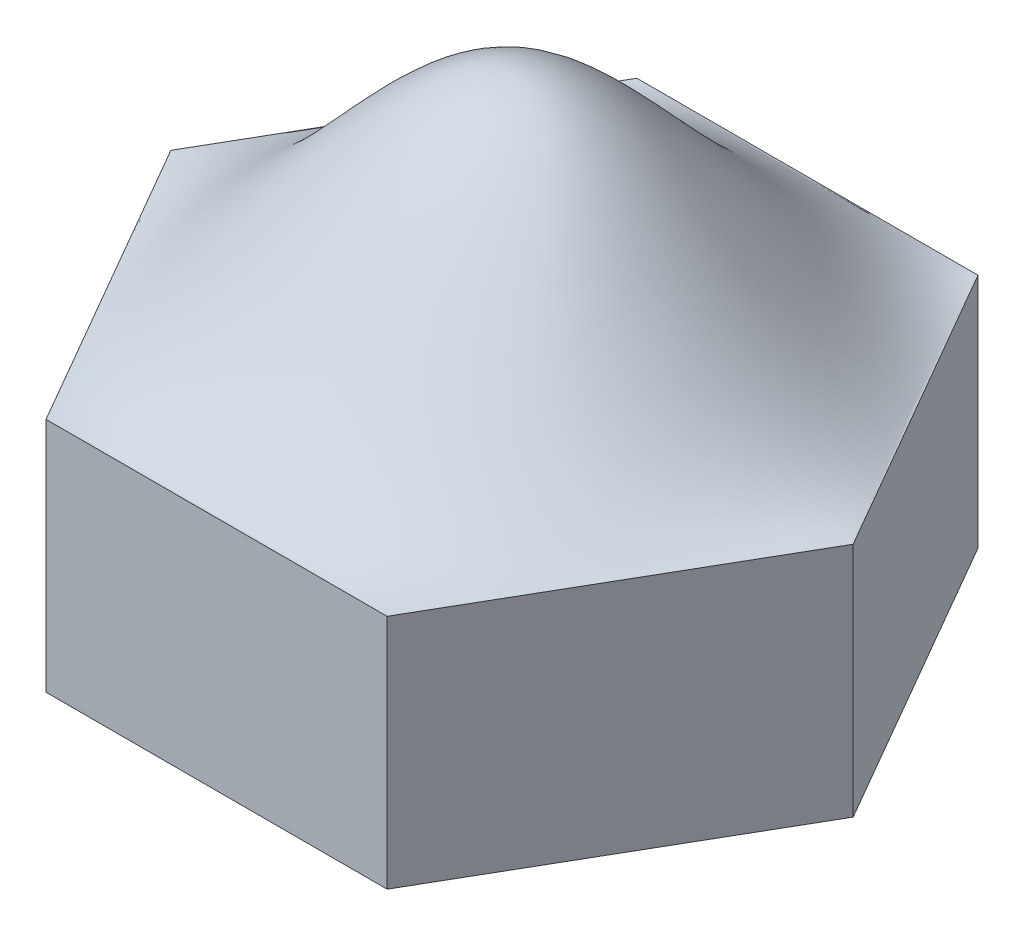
ISO-10303-21;
HEADER;
FILE_DESCRIPTION(('STEP AP214'),'2;1');
FILE_NAME('part.step','',(''),(''),'','','');
FILE_SCHEMA(('AUTOMOTIVE_DESIGN { 1 0 10303 214 1 1 1 1 }'));
ENDSEC;
DATA;
#1=APPLICATION_CONTEXT('core data for automotive mechanical design processes');
#2=APPLICATION_PROTOCOL_DEFINITION('international standard','automotive_design',2000,#1);
#3=PRODUCT_CONTEXT('',#1,'mechanical');
#4=PRODUCT('Part','Part','',(#3));
#5=PRODUCT_RELATED_PRODUCT_CATEGORY('part','',(#4));
#6=PRODUCT_DEFINITION_FORMATION('','',#4);
#7=PRODUCT_DEFINITION_CONTEXT('part definition',#1,'design');
#8=PRODUCT_DEFINITION('design','',#6,#7);
#9=PRODUCT_DEFINITION_SHAPE('','',#8);
#10=(LENGTH_UNIT() NAMED_UNIT(*) SI_UNIT(.MILLI.,.METRE.));
#11=(NAMED_UNIT(*) PLANE_ANGLE_UNIT() SI_UNIT($,.RADIAN.));
#12=(NAMED_UNIT(*) SI_UNIT($,.STERADIAN.) SOLID_ANGLE_UNIT());
#13=UNCERTAINTY_MEASURE_WITH_UNIT(LENGTH_MEASURE(1.E-05),#10,'distance_accuracy_value','');
#14=(GEOMETRIC_REPRESENTATION_CONTEXT(3) GLOBAL_UNCERTAINTY_ASSIGNED_CONTEXT((#13)) GLOBAL_UNIT_ASSIGNED_CONTEXT((#10,
#11,#12)) REPRESENTATION_CONTEXT('',''));
#15=CARTESIAN_POINT('',(0.,0.,0.));
#16=DIRECTION('',(0.,0.,1.));
#17=DIRECTION('',(1.,0.,0.));
#18=AXIS2_PLACEMENT_3D('',#15,#16,#17);
#19=CARTESIAN_POINT('',(28.8675134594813,40.,50.));
#20=DIRECTION('',(-0.866025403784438,0.,-0.5));
#21=DIRECTION('',(-0.5,0.,0.866025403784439));
#22=AXIS2_PLACEMENT_3D('',#19,#20,#21);
#23=PLANE('',#22);
#24=DIRECTION('',(0.5,0.,-0.866025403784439));
#25=VECTOR('',#24,1.);
#26=CARTESIAN_POINT('',(28.8675134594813,0.,50.));
#27=LINE('',#26,#25);
#28=CARTESIAN_POINT('',(28.8675134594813,0.,50.));
#29=VERTEX_POINT('',#28);
#30=CARTESIAN_POINT('',(57.7350269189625,0.,0.));
#31=VERTEX_POINT('',#30);
#32=EDGE_CURVE('E252',#29,#31,#27,.T.);
#33=ORIENTED_EDGE('',*,*,#32,.T.);
#34=DIRECTION('',(0.,-1.,0.));
#35=VECTOR('',#34,1.);
#36=CARTESIAN_POINT('',(57.7350269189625,40.,0.));
#37=LINE('',#36,#35);
#38=CARTESIAN_POINT('',(57.7350267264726,39.9990985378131,-3.33402296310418E-07));
#39=VERTEX_POINT('',#38);
#40=EDGE_CURVE('E13',#39,#31,#37,.T.);
#41=ORIENTED_EDGE('',*,*,#40,.F.);
#42=CARTESIAN_POINT('',(28.8675136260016,39.9993655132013,49.9999997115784));
#43=CARTESIAN_POINT('',(29.033116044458,39.9997100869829,49.7131679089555));
#44=CARTESIAN_POINT('',(29.1987185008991,39.9999448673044,49.4263360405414));
#45=CARTESIAN_POINT('',(29.5299234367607,40.0002662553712,48.8526722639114));
#46=CARTESIAN_POINT('',(29.6955259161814,40.0003528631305,48.5658403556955));
#47=CARTESIAN_POINT('',(30.1923333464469,40.0004975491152,47.7053446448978));
#48=CARTESIAN_POINT('',(30.5235382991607,40.000440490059,47.1316808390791));
#49=CARTESIAN_POINT('',(31.1859481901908,40.0003053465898,45.9843532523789));
#50=CARTESIAN_POINT('',(31.517153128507,40.0002272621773,45.4106894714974));
#51=CARTESIAN_POINT('',(32.1795630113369,40.000117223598,44.2633618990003));
#52=CARTESIAN_POINT('',(32.5107679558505,40.0000852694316,43.6896981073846));
#53=CARTESIAN_POINT('',(33.1731778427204,40.0000407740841,42.5423705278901));
#54=CARTESIAN_POINT('',(33.5043827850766,40.0000282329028,41.9687067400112));
#55=CARTESIAN_POINT('',(34.1667926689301,39.9999853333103,40.8213791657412));
#56=CARTESIAN_POINT('',(34.4979976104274,39.9999549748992,40.24771537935));
#57=CARTESIAN_POINT('',(35.4916124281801,39.9998159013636,38.526724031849));
#58=CARTESIAN_POINT('',(36.1540223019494,39.9996591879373,37.3793964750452));
#59=CARTESIAN_POINT('',(37.4788420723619,39.9995369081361,35.0847413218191));
#60=CARTESIAN_POINT('',(38.141251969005,39.9995713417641,33.9374137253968));
#61=CARTESIAN_POINT('',(39.4660717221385,39.9999895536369,31.6427586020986));
#62=CARTESIAN_POINT('',(40.1284815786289,40.0003733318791,30.4954310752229));
#63=CARTESIAN_POINT('',(41.4533013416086,40.0009219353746,28.2007759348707));
#64=CARTESIAN_POINT('',(42.1157112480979,40.0010867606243,27.0534483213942));
#65=CARTESIAN_POINT('',(43.1093260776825,40.00083322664,25.3324569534));
#66=CARTESIAN_POINT('',(43.4405310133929,40.0006652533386,24.7587931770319));
#67=CARTESIAN_POINT('',(44.1029408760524,40.0002330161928,23.6114656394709));
#68=CARTESIAN_POINT('',(44.4341458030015,39.9999687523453,23.0378018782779));
#69=CARTESIAN_POINT('',(45.0355523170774,39.9995348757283,21.9961352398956));
#70=CARTESIAN_POINT('',(45.3057539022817,39.99935679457,21.5281323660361));
#71=CARTESIAN_POINT('',(45.8461570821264,39.9991779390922,20.5921266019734));
#72=CARTESIAN_POINT('',(46.1163586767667,39.9991771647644,20.1241237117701));
#73=CARTESIAN_POINT('',(46.656761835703,39.9994089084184,19.1881179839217));
#74=CARTESIAN_POINT('',(46.926963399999,39.9996414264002,18.7201151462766));
#75=CARTESIAN_POINT('',(47.4673665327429,40.0001095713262,17.7841094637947));
#76=CARTESIAN_POINT('',(47.7375681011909,40.0003451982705,17.316106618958));
#77=CARTESIAN_POINT('',(48.5481728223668,40.0008937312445,15.9120980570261));
#78=CARTESIAN_POINT('',(49.0885760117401,40.0010482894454,14.9760922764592));
#79=CARTESIAN_POINT('',(50.1693823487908,40.00082701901,13.1040807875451));
#80=CARTESIAN_POINT('',(50.7097854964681,40.0004511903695,12.1680750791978));
#81=CARTESIAN_POINT('',(51.7905917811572,39.9996758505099,10.2960636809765));
#82=CARTESIAN_POINT('',(52.330994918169,39.9992763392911,9.36005799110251));
#83=CARTESIAN_POINT('',(53.4118012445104,39.9989960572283,7.48804652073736));
#84=CARTESIAN_POINT('',(53.95220443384,39.9991152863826,6.55204074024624));
#85=CARTESIAN_POINT('',(54.7628091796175,39.9996483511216,5.14803213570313));
#86=CARTESIAN_POINT('',(55.0330107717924,39.999885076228,4.68002924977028));
#87=CARTESIAN_POINT('',(55.5734139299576,40.0003560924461,3.74402352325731));
#88=CARTESIAN_POINT('',(55.8436154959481,40.000590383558,3.2760206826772));
#89=CARTESIAN_POINT('',(56.3840186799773,40.0008690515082,2.34001491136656));
#90=CARTESIAN_POINT('',(56.6542202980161,40.000913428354,1.87201198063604));
#91=CARTESIAN_POINT('',(57.1946235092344,40.0004803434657,0.936006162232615));
#92=CARTESIAN_POINT('',(57.4648251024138,40.0000028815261,0.468003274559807));
#93=CARTESIAN_POINT('',(57.7350265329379,39.9990985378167,6.68614285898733E-07));
#94=B_SPLINE_CURVE_WITH_KNOTS('',3,(#42,#43,#44,#45,#46,#47,#48,#49,#50,#51,#52,#53,#54,#55,#56,
#57,#58,#59,#60,#61,#62,#63,#64,#65,#66,#67,#68,#69,#70,#71,#72,#73,#74,#75,#76,#77,#78,#79,#80,
#81,#82,#83,#84,#85,#86,#87,#88,#89,#90,#91,#92,#93),.UNSPECIFIED.,.F.,.F.,(4,2,2,2,2,2,2,2,2,2,
2,2,2,2,2,2,2,2,2,2,2,2,2,2,2,4),(0.,0.993614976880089,1.98722985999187,3.97445956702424,
5.96168921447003,7.9489188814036,9.93614853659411,11.9233781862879,15.8978374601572,
19.8722967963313,23.8467561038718,27.821215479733,29.8084451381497,31.7956748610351,
33.4168844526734,35.0380939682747,36.6593034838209,38.280513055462,41.5229320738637,
44.7653511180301,48.0077701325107,51.2501891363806,52.8713988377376,54.4926084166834,
56.1138179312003,57.7350280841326),.UNSPECIFIED.);
#95=CARTESIAN_POINT('',(28.867513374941,39.9993655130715,50.));
#96=VERTEX_POINT('',#95);
#97=EDGE_CURVE('E268',#96,#39,#94,.T.);
#98=ORIENTED_EDGE('',*,*,#97,.F.);
#99=DIRECTION('',(0.,-1.,0.));
#100=VECTOR('',#99,1.);
#101=CARTESIAN_POINT('',(28.8675134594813,40.,50.));
#102=LINE('',#101,#100);
#103=EDGE_CURVE('E260',#96,#29,#102,.T.);
#104=ORIENTED_EDGE('',*,*,#103,.T.);
#105=EDGE_LOOP('',(#33,#41,#98,#104));
#106=FACE_BOUND('',#105,.T.);
#107=ADVANCED_FACE('F176',(#106),#23,.F.);
#108=CARTESIAN_POINT('',(57.7350269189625,40.,0.));
#109=DIRECTION('',(-0.866025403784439,0.,0.5));
#110=DIRECTION('',(0.5,0.,0.866025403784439));
#111=AXIS2_PLACEMENT_3D('',#108,#109,#110);
#112=PLANE('',#111);
#113=DIRECTION('',(-0.5,0.,-0.866025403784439));
#114=VECTOR('',#113,1.);
#115=CARTESIAN_POINT('',(57.7350269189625,0.,0.));
#116=LINE('',#115,#114);
#117=CARTESIAN_POINT('',(28.8675134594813,0.,-50.));
#118=VERTEX_POINT('',#117);
#119=EDGE_CURVE('E249',#31,#118,#116,.T.);
#120=ORIENTED_EDGE('',*,*,#119,.T.);
#121=DIRECTION('',(0.,-1.,0.));
#122=VECTOR('',#121,1.);
#123=CARTESIAN_POINT('',(28.8675134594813,40.,-50.));
#124=LINE('',#123,#122);
#125=CARTESIAN_POINT('',(28.8675133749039,39.9993647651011,-50.));
#126=VERTEX_POINT('',#125);
#127=EDGE_CURVE('E194',#126,#118,#124,.T.);
#128=ORIENTED_EDGE('',*,*,#127,.F.);
#129=CARTESIAN_POINT('',(57.7350265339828,39.9990985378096,-6.6680459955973E-07));
#130=CARTESIAN_POINT('',(57.5694240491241,39.9996618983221,-0.286832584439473));
#131=CARTESIAN_POINT('',(57.4038214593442,40.000054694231,-0.573664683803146));
#132=CARTESIAN_POINT('',(57.0726162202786,40.0005911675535,-1.14732898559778));
#133=CARTESIAN_POINT('',(56.9070135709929,40.0007348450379,-1.43416118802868));
#134=CARTESIAN_POINT('',(56.4102056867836,40.0009302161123,-2.2946576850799));
#135=CARTESIAN_POINT('',(56.0790004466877,40.0007462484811,-2.86832198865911));
#136=CARTESIAN_POINT('',(55.4165900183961,40.000245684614,-4.01565050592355));
#137=CARTESIAN_POINT('',(55.0853848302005,39.9999290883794,-4.58931471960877));
#138=CARTESIAN_POINT('',(54.422974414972,39.9994167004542,-5.7366432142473));
#139=CARTESIAN_POINT('',(54.0917691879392,39.9992209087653,-6.3103074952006));
#140=CARTESIAN_POINT('',(53.0981535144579,39.9989703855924,-8.03130032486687));
#141=CARTESIAN_POINT('',(52.4357430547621,39.9992525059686,-9.17862889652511));
#142=CARTESIAN_POINT('',(51.1109222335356,40.0000946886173,-11.4732858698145));
#143=CARTESIAN_POINT('',(50.4485118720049,40.0006547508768,-12.6206142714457));
#144=CARTESIAN_POINT('',(49.4548962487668,40.0009682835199,-14.3416070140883));
#145=CARTESIAN_POINT('',(49.1236910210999,40.0009850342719,-14.9152712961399));
#146=CARTESIAN_POINT('',(48.4612805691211,40.0008218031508,-16.0625998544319));
#147=CARTESIAN_POINT('',(48.1300753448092,40.0006418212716,-16.6362641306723));
#148=CARTESIAN_POINT('',(47.4676649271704,40.0001432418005,-17.7835926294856));
#149=CARTESIAN_POINT('',(47.1364597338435,39.9998246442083,-18.3572568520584));
#150=CARTESIAN_POINT('',(46.4740493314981,39.9993203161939,-19.5045853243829));
#151=CARTESIAN_POINT('',(46.1428441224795,39.9991345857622,-20.0782495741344));
#152=CARTESIAN_POINT('',(45.480433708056,39.9991420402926,-21.2255780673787));
#153=CARTESIAN_POINT('',(45.1492285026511,39.9993352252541,-21.7992423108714));
#154=CARTESIAN_POINT('',(44.4868180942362,39.9997968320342,-22.9465707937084));
#155=CARTESIAN_POINT('',(44.1556128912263,40.0000652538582,-23.5202350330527));
#156=CARTESIAN_POINT('',(43.493202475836,40.0005236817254,-24.6675635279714));
#157=CARTESIAN_POINT('',(43.1619972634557,40.0007136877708,-25.2412277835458));
#158=CARTESIAN_POINT('',(42.4995868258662,40.0009415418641,-26.3885563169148));
#159=CARTESIAN_POINT('',(42.168381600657,40.0009793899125,-26.9622205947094));
#160=CARTESIAN_POINT('',(41.2967737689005,40.0009006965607,-28.4718896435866));
#161=CARTESIAN_POINT('',(40.7563711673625,40.0006715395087,-29.4078944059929));
#162=CARTESIAN_POINT('',(39.6755659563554,40.0001823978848,-31.2799039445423));
#163=CARTESIAN_POINT('',(39.1351633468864,39.9999224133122,-32.2159087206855));
#164=CARTESIAN_POINT('',(38.0543581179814,39.9996159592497,-34.087918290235));
#165=CARTESIAN_POINT('',(37.5139554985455,39.9995694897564,-35.0239230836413));
#166=CARTESIAN_POINT('',(36.4331502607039,39.9996264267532,-36.8959326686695));
#167=CARTESIAN_POINT('',(35.8927476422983,39.9997298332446,-37.8319374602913));
#168=CARTESIAN_POINT('',(34.811942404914,39.9998945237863,-39.7039470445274));
#169=CARTESIAN_POINT('',(34.2715397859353,39.9999558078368,-40.6399518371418));
#170=CARTESIAN_POINT('',(33.1907345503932,40.0000368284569,-42.5119614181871));
#171=CARTESIAN_POINT('',(32.6503319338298,40.0000565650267,-43.4479662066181));
#172=CARTESIAN_POINT('',(31.8397280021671,40.0001726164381,-44.851973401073));
#173=CARTESIAN_POINT('',(31.5695266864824,40.0002257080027,-45.319975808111));
#174=CARTESIAN_POINT('',(31.0291240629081,40.0003426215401,-46.255980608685));
#175=CARTESIAN_POINT('',(30.7589227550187,40.0004064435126,-46.7239830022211));
#176=CARTESIAN_POINT('',(30.2185201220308,40.0004714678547,-47.6599878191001));
#177=CARTESIAN_POINT('',(29.9483187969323,40.0004726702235,-48.1279902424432));
#178=CARTESIAN_POINT('',(29.4079161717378,40.0001890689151,-49.0639950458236));
#179=CARTESIAN_POINT('',(29.1377148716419,39.9999042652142,-49.531997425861));
#180=CARTESIAN_POINT('',(28.8675136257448,39.9993647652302,-49.9999997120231));
#181=B_SPLINE_CURVE_WITH_KNOTS('',3,(#129,#130,#131,#132,#133,#134,#135,#136,#137,#138,#139,
#140,#141,#142,#143,#144,#145,#146,#147,#148,#149,#150,#151,#152,#153,#154,#155,#156,#157,#158,
#159,#160,#161,#162,#163,#164,#165,#166,#167,#168,#169,#170,#171,#172,#173,#174,#175,#176,#177,
#178,#179,#180),.UNSPECIFIED.,.F.,.F.,(4,2,2,2,2,2,2,2,2,2,2,2,2,2,2,2,2,2,2,2,2,2,2,2,2,4),(0.,
0.993616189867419,1.98723209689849,3.97446349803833,5.96169488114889,7.94892628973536,
11.9233889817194,15.897851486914,17.8850828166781,19.8723142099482,21.8595456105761,
23.8467768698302,25.8340081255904,27.8212395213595,29.8084708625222,31.7957021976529,
35.0381178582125,38.2805336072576,41.5229493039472,44.7653650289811,48.0077807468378,
51.2501964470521,52.8714043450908,54.4926122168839,56.1138201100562,57.7350281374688),.UNSPECIFIED.);
#182=EDGE_CURVE('E183',#39,#126,#181,.T.);
#183=ORIENTED_EDGE('',*,*,#182,.F.);
#184=ORIENTED_EDGE('',*,*,#40,.T.);
#185=EDGE_LOOP('',(#120,#128,#183,#184));
#186=FACE_BOUND('',#185,.T.);
#187=ADVANCED_FACE('F257',(#186),#112,.F.);
#188=CARTESIAN_POINT('',(28.8675134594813,40.,-50.));
#189=DIRECTION('',(0.,0.,1.));
#190=DIRECTION('',(1.,0.,0.));
#191=AXIS2_PLACEMENT_3D('',#188,#189,#190);
#192=PLANE('',#191);
#193=DIRECTION('',(-1.,0.,0.));
#194=VECTOR('',#193,1.);
#195=CARTESIAN_POINT('',(28.8675134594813,0.,-50.));
#196=LINE('',#195,#194);
#197=CARTESIAN_POINT('',(-28.8675134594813,0.,-50.));
#198=VERTEX_POINT('',#197);
#199=EDGE_CURVE('E254',#118,#198,#196,.T.);
#200=ORIENTED_EDGE('',*,*,#199,.T.);
#201=DIRECTION('',(0.,-1.,0.));
#202=VECTOR('',#201,1.);
#203=CARTESIAN_POINT('',(-28.8675134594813,40.,-50.));
#204=LINE('',#203,#202);
#205=CARTESIAN_POINT('',(-28.8675135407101,39.9993764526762,-49.9999998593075));
#206=VERTEX_POINT('',#205);
#207=EDGE_CURVE('E272',#206,#198,#204,.T.);
#208=ORIENTED_EDGE('',*,*,#207,.F.);
#209=CARTESIAN_POINT('',(28.8675132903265,39.9993647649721,-50.));
#210=CARTESIAN_POINT('',(28.5363085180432,39.9995351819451,-50.));
#211=CARTESIAN_POINT('',(28.205103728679,39.9996399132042,-50.));
#212=CARTESIAN_POINT('',(27.5426941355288,39.9997834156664,-50.));
#213=CARTESIAN_POINT('',(27.2114893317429,39.9998221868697,-50.));
#214=CARTESIAN_POINT('',(26.2178749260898,39.9999376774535,-50.));
#215=CARTESIAN_POINT('',(25.5554653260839,40.0000135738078,-50.));
#216=CARTESIAN_POINT('',(23.5682365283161,40.0001938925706,-50.));
#217=CARTESIAN_POINT('',(22.2434173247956,40.0002509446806,-50.));
#218=CARTESIAN_POINT('',(18.2689597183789,40.0003271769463,-50.));
#219=CARTESIAN_POINT('',(15.6193213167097,40.0002514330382,-50.));
#220=CARTESIAN_POINT('',(10.3200448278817,40.0000590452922,-50.));
#221=CARTESIAN_POINT('',(7.67040674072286,39.9999424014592,-50.));
#222=CARTESIAN_POINT('',(2.37113056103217,39.9998049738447,-50.));
#223=CARTESIAN_POINT('',(-0.278507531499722,39.9997841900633,-49.9999999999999));
#224=CARTESIAN_POINT('',(-5.08975960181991,39.9998512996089,-49.9999999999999));
#225=CARTESIAN_POINT('',(-7.25137357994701,39.9999198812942,-50.));
#226=CARTESIAN_POINT('',(-11.5746015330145,40.0000872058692,-50.));
#227=CARTESIAN_POINT('',(-13.7362155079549,40.0001859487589,-50.));
#228=CARTESIAN_POINT('',(-18.0594434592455,40.0003098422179,-50.));
#229=CARTESIAN_POINT('',(-20.2210574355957,40.0003349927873,-50.));
#230=CARTESIAN_POINT('',(-23.4634784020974,40.0002006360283,-50.));
#231=CARTESIAN_POINT('',(-24.5442853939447,40.000127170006,-50.));
#232=CARTESIAN_POINT('',(-26.1654958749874,39.9999455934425,-50.));
#233=CARTESIAN_POINT('',(-26.7058993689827,39.999873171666,-50.));
#234=CARTESIAN_POINT('',(-27.5165046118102,39.9997550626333,-50.));
#235=CARTESIAN_POINT('',(-27.7867063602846,39.999714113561,-50.));
#236=CARTESIAN_POINT('',(-28.3271098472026,39.9995883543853,-50.));
#237=CARTESIAN_POINT('',(-28.5973115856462,39.9995035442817,-50.));
#238=CARTESIAN_POINT('',(-28.8675133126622,39.9993764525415,-50.));
#239=B_SPLINE_CURVE_WITH_KNOTS('',3,(#209,#210,#211,#212,#213,#214,#215,#216,#217,#218,#219,
#220,#221,#222,#223,#224,#225,#226,#227,#228,#229,#230,#231,#232,#233,#234,#235,#236,#237,#238),
.UNSPECIFIED.,.F.,.F.,(4,2,2,2,2,2,2,2,2,2,2,2,2,2,4),(0.,0.993614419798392,1.98722883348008,
3.97445764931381,7.94891525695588,15.8978304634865,23.8467447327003,31.7956590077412,
38.2805009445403,44.765342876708,51.2501848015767,54.4926057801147,56.1138162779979,
56.9244215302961,57.7350267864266),.UNSPECIFIED.);
#240=EDGE_CURVE('E302',#126,#206,#239,.T.);
#241=ORIENTED_EDGE('',*,*,#240,.F.);
#242=ORIENTED_EDGE('',*,*,#127,.T.);
#243=EDGE_LOOP('',(#200,#208,#241,#242));
#244=FACE_BOUND('',#243,.T.);
#245=ADVANCED_FACE('F294',(#244),#192,.F.);
#246=CARTESIAN_POINT('',(-28.8675134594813,40.,-50.));
#247=DIRECTION('',(0.866025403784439,0.,0.5));
#248=DIRECTION('',(0.5,0.,-0.866025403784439));
#249=AXIS2_PLACEMENT_3D('',#246,#247,#248);
#250=PLANE('',#249);
#251=DIRECTION('',(-0.5,0.,0.866025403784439));
#252=VECTOR('',#251,1.);
#253=CARTESIAN_POINT('',(-28.8675134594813,0.,-50.));
#254=LINE('',#253,#252);
#255=CARTESIAN_POINT('',(-57.7350269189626,0.,0.));
#256=VERTEX_POINT('',#255);
#257=EDGE_CURVE('E264',#198,#256,#254,.T.);
#258=ORIENTED_EDGE('',*,*,#257,.T.);
#259=DIRECTION('',(0.,-1.,0.));
#260=VECTOR('',#259,1.);
#261=CARTESIAN_POINT('',(-57.7350269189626,40.,0.));
#262=LINE('',#261,#260);
#263=CARTESIAN_POINT('',(-57.7350267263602,39.9990994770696,3.33597084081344E-07));
#264=VERTEX_POINT('',#263);
#265=EDGE_CURVE('E275',#264,#256,#262,.T.);
#266=ORIENTED_EDGE('',*,*,#265,.F.);
#267=CARTESIAN_POINT('',(-28.867513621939,39.9993764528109,-49.9999997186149));
#268=CARTESIAN_POINT('',(-29.0331160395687,39.9997185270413,-49.7131679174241));
#269=CARTESIAN_POINT('',(-29.1987184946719,39.9999513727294,-49.4263360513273));
#270=CARTESIAN_POINT('',(-29.5299234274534,40.0002696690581,-48.8526722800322));
#271=CARTESIAN_POINT('',(-29.6955259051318,40.0003551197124,-48.5658403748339));
#272=CARTESIAN_POINT('',(-30.1923333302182,40.0004969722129,-47.7053446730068));
#273=CARTESIAN_POINT('',(-30.5235382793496,40.0004388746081,-47.1316808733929));
#274=CARTESIAN_POINT('',(-31.1859481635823,40.0003022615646,-45.984353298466));
#275=CARTESIAN_POINT('',(-31.5171530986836,40.0002237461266,-45.4106895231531));
#276=CARTESIAN_POINT('',(-32.179562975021,40.0001131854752,-44.2633619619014));
#277=CARTESIAN_POINT('',(-32.5107679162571,40.0000811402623,-43.6896981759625));
#278=CARTESIAN_POINT('',(-33.1731777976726,40.0000368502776,-42.5423706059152));
#279=CARTESIAN_POINT('',(-33.504382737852,40.0000246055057,-41.9687068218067));
#280=CARTESIAN_POINT('',(-34.1667926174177,39.9999828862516,-40.8213792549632));
#281=CARTESIAN_POINT('',(-34.4979975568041,39.9999534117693,-40.2477154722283));
#282=CARTESIAN_POINT('',(-35.4916123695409,39.9998181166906,-38.5267241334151));
#283=CARTESIAN_POINT('',(-36.1540222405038,39.9996654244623,-37.3793965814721));
#284=CARTESIAN_POINT('',(-37.4788420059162,39.9995533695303,-35.0847414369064));
#285=CARTESIAN_POINT('',(-38.1412519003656,39.9995940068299,-33.9374138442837));
#286=CARTESIAN_POINT('',(-39.4660716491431,40.0000142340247,-31.6427587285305));
#287=CARTESIAN_POINT('',(-40.1284815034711,40.000393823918,-30.4954312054));
#288=CARTESIAN_POINT('',(-41.4533012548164,40.0009313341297,-28.2007760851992));
#289=CARTESIAN_POINT('',(-42.1157111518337,40.0010892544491,-27.0534484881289));
#290=CARTESIAN_POINT('',(-43.4405309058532,40.0007008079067,-24.7587933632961));
#291=CARTESIAN_POINT('',(-44.1029407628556,40.0001544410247,-23.6114658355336));
#292=CARTESIAN_POINT('',(-45.0355522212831,39.9995106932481,-21.9961354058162));
#293=CARTESIAN_POINT('',(-45.3057538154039,39.999339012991,-21.5281325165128));
#294=CARTESIAN_POINT('',(-45.846157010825,39.9991962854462,-20.592126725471));
#295=CARTESIAN_POINT('',(-46.1163586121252,39.9992252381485,-20.1241238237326));
#296=CARTESIAN_POINT('',(-46.6567617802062,39.999486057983,-19.188118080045));
#297=CARTESIAN_POINT('',(-46.926963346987,39.9997179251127,-18.720115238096));
#298=CARTESIAN_POINT('',(-47.4673664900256,40.0001700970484,-17.7841095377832));
#299=CARTESIAN_POINT('',(-47.7375680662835,40.000390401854,-17.3161066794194));
#300=CARTESIAN_POINT('',(-48.5481728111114,40.0008930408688,-15.9120980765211));
#301=CARTESIAN_POINT('',(-49.0885760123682,40.0010170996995,-14.9760922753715));
#302=CARTESIAN_POINT('',(-50.1693823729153,40.0007697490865,-13.1040807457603));
#303=CARTESIAN_POINT('',(-50.7097855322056,40.0003983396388,-12.1680750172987));
#304=CARTESIAN_POINT('',(-51.7905918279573,39.9996466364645,-10.2960635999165));
#305=CARTESIAN_POINT('',(-52.3309949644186,39.9992663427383,-9.36005791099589));
#306=CARTESIAN_POINT('',(-53.4118012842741,39.9990118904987,-7.4880464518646));
#307=CARTESIAN_POINT('',(-53.9522044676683,39.9991377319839,-6.5520406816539));
#308=CARTESIAN_POINT('',(-54.7628092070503,39.9996682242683,-5.14803208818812));
#309=CARTESIAN_POINT('',(-55.0330107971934,39.9999020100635,-4.68002920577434));
#310=CARTESIAN_POINT('',(-55.5734139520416,40.0003655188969,-3.74402348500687));
#311=CARTESIAN_POINT('',(-55.8436155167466,40.0005952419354,-3.27602064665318));
#312=CARTESIAN_POINT('',(-56.3840186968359,40.0008664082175,-2.3400148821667));
#313=CARTESIAN_POINT('',(-56.6542203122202,40.0009078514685,-1.87201195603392));
#314=CARTESIAN_POINT('',(-57.1946235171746,40.0004736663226,-0.936006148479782));
#315=CARTESIAN_POINT('',(-57.4648251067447,39.9999980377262,-0.468003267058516));
#316=CARTESIAN_POINT('',(-57.7350265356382,39.9990994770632,-6.63937340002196E-07));
#317=B_SPLINE_CURVE_WITH_KNOTS('',3,(#267,#268,#269,#270,#271,#272,#273,#274,#275,#276,#277,
#278,#279,#280,#281,#282,#283,#284,#285,#286,#287,#288,#289,#290,#291,#292,#293,#294,#295,#296,
#297,#298,#299,#300,#301,#302,#303,#304,#305,#306,#307,#308,#309,#310,#311,#312,#313,#314,#315,
#316),.UNSPECIFIED.,.F.,.F.,(4,2,2,2,2,2,2,2,2,2,2,2,2,2,2,2,2,2,2,2,2,2,2,2,4),(0.,
0.99361496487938,1.9872298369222,3.97445952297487,5.9616891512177,7.94891879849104,
9.93614844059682,11.9233780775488,15.8978373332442,19.872296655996,23.8467559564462,
27.8212152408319,31.7956746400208,33.4168842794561,35.0380938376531,36.6593033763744,
38.2805129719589,41.5229320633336,44.7653511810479,48.0077701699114,51.2501891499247,
52.8713988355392,54.4926084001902,56.1138179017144,57.7350280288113),.UNSPECIFIED.);
#318=EDGE_CURVE('E309',#206,#264,#317,.T.);
#319=ORIENTED_EDGE('',*,*,#318,.F.);
#320=ORIENTED_EDGE('',*,*,#207,.T.);
#321=EDGE_LOOP('',(#258,#266,#319,#320));
#322=FACE_BOUND('',#321,.T.);
#323=ADVANCED_FACE('F298',(#322),#250,.F.);
#324=CARTESIAN_POINT('',(-57.7350269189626,40.,0.));
#325=DIRECTION('',(0.866025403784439,0.,-0.5));
#326=DIRECTION('',(-0.5,0.,-0.866025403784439));
#327=AXIS2_PLACEMENT_3D('',#324,#325,#326);
#328=PLANE('',#327);
#329=DIRECTION('',(0.5,0.,0.866025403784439));
#330=VECTOR('',#329,1.);
#331=CARTESIAN_POINT('',(-57.7350269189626,0.,0.));
#332=LINE('',#331,#330);
#333=CARTESIAN_POINT('',(-28.8675134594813,0.,50.));
#334=VERTEX_POINT('',#333);
#335=EDGE_CURVE('E234',#256,#334,#332,.T.);
#336=ORIENTED_EDGE('',*,*,#335,.T.);
#337=DIRECTION('',(0.,-1.,0.));
#338=VECTOR('',#337,1.);
#339=CARTESIAN_POINT('',(-28.8675134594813,40.,50.));
#340=LINE('',#339,#338);
#341=CARTESIAN_POINT('',(-28.8675133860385,39.9993767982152,50.));
#342=VERTEX_POINT('',#341);
#343=EDGE_CURVE('E269',#342,#334,#340,.T.);
#344=ORIENTED_EDGE('',*,*,#343,.F.);
#345=CARTESIAN_POINT('',(-57.7350265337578,39.9990994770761,6.67194181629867E-07));
#346=CARTESIAN_POINT('',(-57.5694240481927,39.9996638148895,0.286832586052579));
#347=CARTESIAN_POINT('',(-57.4038214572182,40.0000571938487,0.573664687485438));
#348=CARTESIAN_POINT('',(-57.0726162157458,40.0005940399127,1.14732899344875));
#349=CARTESIAN_POINT('',(-56.907013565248,40.0007375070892,1.43416119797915));
#350=CARTESIAN_POINT('',(-56.4102056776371,40.0009310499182,2.29465770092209));
#351=CARTESIAN_POINT('',(-56.0790004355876,40.0007442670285,2.86832200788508));
#352=CARTESIAN_POINT('',(-55.4165900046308,40.0002379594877,4.01565052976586));
#353=CARTESIAN_POINT('',(-55.0853848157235,39.999918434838,4.58931474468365));
#354=CARTESIAN_POINT('',(-54.4229743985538,39.9994031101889,5.73664324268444));
#355=CARTESIAN_POINT('',(-54.0917691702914,39.9992073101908,6.31030752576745));
#356=CARTESIAN_POINT('',(-53.0981534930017,39.998964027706,8.0313003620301));
#357=CARTESIAN_POINT('',(-52.4357430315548,39.9992606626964,9.1786289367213));
#358=CARTESIAN_POINT('',(-51.1109222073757,40.0001259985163,11.4732859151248));
#359=CARTESIAN_POINT('',(-50.4485118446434,40.000694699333,12.6206143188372));
#360=CARTESIAN_POINT('',(-49.4548962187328,40.0009976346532,14.3416070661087));
#361=CARTESIAN_POINT('',(-49.1236909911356,40.0010069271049,14.9152713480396));
#362=CARTESIAN_POINT('',(-48.4612805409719,40.0008221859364,16.0625999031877));
#363=CARTESIAN_POINT('',(-48.1300753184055,40.0006281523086,16.6362641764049));
#364=CARTESIAN_POINT('',(-47.467664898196,40.0001186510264,17.7835926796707));
#365=CARTESIAN_POINT('',(-47.136459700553,39.9998031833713,18.3572569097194));
#366=CARTESIAN_POINT('',(-46.6396518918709,39.9994280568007,19.2177532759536));
#367=CARTESIAN_POINT('',(-46.4740492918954,39.9993193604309,19.5045853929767));
#368=CARTESIAN_POINT('',(-46.1428440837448,39.999196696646,20.078249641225));
#369=CARTESIAN_POINT('',(-45.9772414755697,39.9991827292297,20.3650817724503));
#370=CARTESIAN_POINT('',(-45.480433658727,39.9992563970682,21.2255781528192));
#371=CARTESIAN_POINT('',(-45.1492284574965,39.9994596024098,21.7992423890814));
#372=CARTESIAN_POINT('',(-44.486818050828,39.9999303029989,22.9465708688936));
#373=CARTESIAN_POINT('',(-44.1556128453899,40.0001977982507,23.5202351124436));
#374=CARTESIAN_POINT('',(-43.493202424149,40.00063696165,24.667563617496));
#375=CARTESIAN_POINT('',(-43.1619972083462,40.0008086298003,25.2412278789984));
#376=CARTESIAN_POINT('',(-42.4995867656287,40.0009963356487,26.3885564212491));
#377=CARTESIAN_POINT('',(-42.1683815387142,40.001012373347,26.9622207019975));
#378=CARTESIAN_POINT('',(-41.296773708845,40.0008820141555,28.4718897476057));
#379=CARTESIAN_POINT('',(-40.7563711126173,40.0006266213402,29.4078945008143));
#380=CARTESIAN_POINT('',(-39.675565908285,40.0001135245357,31.2799040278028));
#381=CARTESIAN_POINT('',(-39.1351633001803,39.9998558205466,32.2159088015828));
#382=CARTESIAN_POINT('',(-38.05435807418,39.9995710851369,34.0879183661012));
#383=CARTESIAN_POINT('',(-37.5139554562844,39.9995440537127,35.0239231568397));
#384=CARTESIAN_POINT('',(-36.4331502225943,39.9996346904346,36.8959327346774));
#385=CARTESIAN_POINT('',(-35.8927476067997,39.999752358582,37.8319375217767));
#386=CARTESIAN_POINT('',(-34.8119423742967,39.9999276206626,39.7039470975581));
#387=CARTESIAN_POINT('',(-34.2715397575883,39.9999852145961,40.6399518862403));
#388=CARTESIAN_POINT('',(-33.1907345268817,40.0000498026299,42.5119614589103));
#389=CARTESIAN_POINT('',(-32.6503319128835,40.0000567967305,43.4479662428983));
#390=CARTESIAN_POINT('',(-31.839727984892,40.0001616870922,44.8519734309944));
#391=CARTESIAN_POINT('',(-31.5695266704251,40.0002123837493,45.3199758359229));
#392=CARTESIAN_POINT('',(-31.0291240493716,40.0003283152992,46.255980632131));
#393=CARTESIAN_POINT('',(-30.7589227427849,40.0003935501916,46.7239830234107));
#394=CARTESIAN_POINT('',(-30.2185201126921,40.0004645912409,47.6599878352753));
#395=CARTESIAN_POINT('',(-29.948318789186,40.000470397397,48.1279902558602));
#396=CARTESIAN_POINT('',(-29.4079161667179,40.000195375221,49.0639950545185));
#397=CARTESIAN_POINT('',(-29.1377148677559,39.9999145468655,49.5319974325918));
#398=CARTESIAN_POINT('',(-28.8675136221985,39.9993767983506,49.9999997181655));
#399=B_SPLINE_CURVE_WITH_KNOTS('',3,(#345,#346,#347,#348,#349,#350,#351,#352,#353,#354,#355,
#356,#357,#358,#359,#360,#361,#362,#363,#364,#365,#366,#367,#368,#369,#370,#371,#372,#373,#374,
#375,#376,#377,#378,#379,#380,#381,#382,#383,#384,#385,#386,#387,#388,#389,#390,#391,#392,#393,
#394,#395,#396,#397,#398),.UNSPECIFIED.,.F.,.F.,(4,2,2,2,2,2,2,2,2,2,2,2,2,2,2,2,2,2,2,2,2,2,2,
2,2,2,4),(0.,0.993616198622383,1.9872321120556,3.97446352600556,5.96169491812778,
7.94892633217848,11.9233890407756,15.8978515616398,17.8850828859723,19.8723142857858,
21.8595456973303,22.8531613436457,23.8467769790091,25.8340082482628,27.8212396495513,
29.808470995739,31.7957023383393,35.0381179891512,38.2805337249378,41.5229494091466,
44.7653651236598,48.0077808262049,51.2501965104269,52.8714044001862,54.4926122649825,
56.1138201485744,57.735028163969),.UNSPECIFIED.);
#400=EDGE_CURVE('E315',#264,#342,#399,.T.);
#401=ORIENTED_EDGE('',*,*,#400,.F.);
#402=ORIENTED_EDGE('',*,*,#265,.T.);
#403=EDGE_LOOP('',(#336,#344,#401,#402));
#404=FACE_BOUND('',#403,.T.);
#405=ADVANCED_FACE('F320',(#404),#328,.F.);
#406=CARTESIAN_POINT('',(-28.8675134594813,40.,50.));
#407=DIRECTION('',(0.,0.,-1.));
#408=DIRECTION('',(-1.,0.,0.));
#409=AXIS2_PLACEMENT_3D('',#406,#407,#408);
#410=PLANE('',#409);
#411=DIRECTION('',(1.,0.,0.));
#412=VECTOR('',#411,1.);
#413=CARTESIAN_POINT('',(-28.8675134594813,0.,50.));
#414=LINE('',#413,#412);
#415=EDGE_CURVE('E227',#334,#29,#414,.T.);
#416=ORIENTED_EDGE('',*,*,#415,.T.);
#417=ORIENTED_EDGE('',*,*,#103,.F.);
#418=CARTESIAN_POINT('',(-28.8675133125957,39.9993767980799,49.9999999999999));
#419=CARTESIAN_POINT('',(-28.5363085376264,39.999523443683,50.));
#420=CARTESIAN_POINT('',(-28.2051037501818,39.9996198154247,50.));
#421=CARTESIAN_POINT('',(-27.5426941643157,39.9997608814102,50.));
#422=CARTESIAN_POINT('',(-27.2114893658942,39.9998055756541,50.));
#423=CARTESIAN_POINT('',(-26.2178749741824,39.9999354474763,50.));
#424=CARTESIAN_POINT('',(-25.5554653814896,40.0000164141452,50.));
#425=CARTESIAN_POINT('',(-23.5682366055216,40.0002075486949,50.));
#426=CARTESIAN_POINT('',(-22.2434174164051,40.0002659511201,50.));
#427=CARTESIAN_POINT('',(-18.2689598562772,40.000337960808,50.));
#428=CARTESIAN_POINT('',(-15.6193214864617,40.0002483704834,50.));
#429=CARTESIAN_POINT('',(-10.3200447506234,40.0000426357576,50.));
#430=CARTESIAN_POINT('',(-7.67040638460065,39.9999264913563,50.));
#431=CARTESIAN_POINT('',(-2.37112964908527,39.9997962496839,50.));
#432=CARTESIAN_POINT('',(0.278508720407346,39.9997821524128,50.));
#433=CARTESIAN_POINT('',(7.25137479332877,39.9999054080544,50.));
#434=CARTESIAN_POINT('',(11.5746024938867,40.0001440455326,50.));
#435=CARTESIAN_POINT('',(18.0594440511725,40.0003009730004,50.));
#436=CARTESIAN_POINT('',(20.2210579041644,40.0003197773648,50.));
#437=CARTESIAN_POINT('',(23.4634786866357,40.0001873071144,50.));
#438=CARTESIAN_POINT('',(24.5442856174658,40.0001163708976,50.));
#439=CARTESIAN_POINT('',(26.1654960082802,39.9999503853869,50.));
#440=CARTESIAN_POINT('',(26.7058994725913,39.9998851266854,50.));
#441=CARTESIAN_POINT('',(27.5165046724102,39.9997759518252,50.));
#442=CARTESIAN_POINT('',(27.7867064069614,39.9997376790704,50.));
#443=CARTESIAN_POINT('',(28.3271098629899,39.9996058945,50.));
#444=CARTESIAN_POINT('',(28.5973115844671,39.9995123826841,50.));
#445=CARTESIAN_POINT('',(28.8675132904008,39.9993655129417,50.));
#446=B_SPLINE_CURVE_WITH_KNOTS('',3,(#418,#419,#420,#421,#422,#423,#424,#425,#426,#427,#428,
#429,#430,#431,#432,#433,#434,#435,#436,#437,#438,#439,#440,#441,#442,#443,#444,#445),
.UNSPECIFIED.,.F.,.F.,(4,2,2,2,2,2,2,2,2,2,2,2,2,4),(0.,0.993614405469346,1.98722880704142,
3.9744576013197,7.94891516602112,15.8978302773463,23.8467453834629,31.7956604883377,
44.7653436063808,51.2501851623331,54.4926059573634,56.1138163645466,56.9244215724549,
57.7350267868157),.UNSPECIFIED.);
#447=EDGE_CURVE('E203',#342,#96,#446,.T.);
#448=ORIENTED_EDGE('',*,*,#447,.F.);
#449=ORIENTED_EDGE('',*,*,#343,.T.);
#450=EDGE_LOOP('',(#416,#417,#448,#449));
#451=FACE_BOUND('',#450,.T.);
#452=ADVANCED_FACE('F323',(#451),#410,.F.);
#453=CARTESIAN_POINT('',(57.7350269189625,0.,0.));
#454=DIRECTION('',(0.,1.,0.));
#455=DIRECTION('',(0.,0.,1.));
#456=AXIS2_PLACEMENT_3D('',#453,#454,#455);
#457=PLANE('',#456);
#458=ORIENTED_EDGE('',*,*,#32,.F.);
#459=ORIENTED_EDGE('',*,*,#415,.F.);
#460=ORIENTED_EDGE('',*,*,#335,.F.);
#461=ORIENTED_EDGE('',*,*,#257,.F.);
#462=ORIENTED_EDGE('',*,*,#199,.F.);
#463=ORIENTED_EDGE('',*,*,#119,.F.);
#464=EDGE_LOOP('',(#458,#459,#460,#461,#462,#463));
#465=FACE_BOUND('',#464,.T.);
#466=ADVANCED_FACE('F250',(#465),#457,.F.);
#467=CARTESIAN_POINT('',(-58.8897274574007,43.695467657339,-51.0000000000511));
#468=CARTESIAN_POINT('',(-52.6135677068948,41.4388805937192,-51.0000000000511));
#469=CARTESIAN_POINT('',(-46.337407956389,40.2740505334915,-51.0000000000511));
#470=CARTESIAN_POINT('',(-40.0612482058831,40.3615744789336,-51.0000000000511));
#471=CARTESIAN_POINT('',(-22.8082436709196,39.8358493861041,-51.0000000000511));
#472=CARTESIAN_POINT('',(-5.55523913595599,39.2652987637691,-51.0000000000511));
#473=CARTESIAN_POINT('',(5.42160564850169,39.2639781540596,-51.0000000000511));
#474=CARTESIAN_POINT('',(22.7013368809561,39.8302527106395,-51.0000000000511));
#475=CARTESIAN_POINT('',(39.9810681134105,40.360637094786,-51.0000000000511));
#476=CARTESIAN_POINT('',(46.2839545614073,40.2523027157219,-51.0000000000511));
#477=CARTESIAN_POINT('',(52.586841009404,41.4129985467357,-51.0000000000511));
#478=CARTESIAN_POINT('',(58.8897274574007,43.6731879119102,-51.0000000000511));
#479=CARTESIAN_POINT('',(-58.8897274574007,39.1428361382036,-44.8283236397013));
#480=CARTESIAN_POINT('',(-52.6135677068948,37.5622685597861,-44.8283236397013));
#481=CARTESIAN_POINT('',(-46.337407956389,37.2305673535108,-44.8283236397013));
#482=CARTESIAN_POINT('',(-40.0612482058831,37.9922321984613,-44.8283236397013));
#483=CARTESIAN_POINT('',(-22.8082436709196,40.7609711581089,-44.8283236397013));
#484=CARTESIAN_POINT('',(-5.55523913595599,43.7011353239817,-44.8283236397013));
#485=CARTESIAN_POINT('',(5.42160564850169,43.7097858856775,-44.8283236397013));
#486=CARTESIAN_POINT('',(22.7013368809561,40.7875192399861,-44.8283236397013));
#487=CARTESIAN_POINT('',(39.9810681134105,37.9997157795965,-44.8283236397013));
#488=CARTESIAN_POINT('',(46.2839545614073,37.221667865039,-44.8283236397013));
#489=CARTESIAN_POINT('',(52.586841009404,37.5438177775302,-44.8283236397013));
#490=CARTESIAN_POINT('',(58.8897274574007,39.1264238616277,-44.8283236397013));
#491=CARTESIAN_POINT('',(-58.8897274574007,36.2394651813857,-38.6566472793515));
#492=CARTESIAN_POINT('',(-52.6135677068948,35.3794909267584,-38.6566472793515));
#493=CARTESIAN_POINT('',(-46.337407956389,35.5491616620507,-38.6566472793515));
#494=CARTESIAN_POINT('',(-40.0612482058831,37.4071677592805,-38.6566472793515));
#495=CARTESIAN_POINT('',(-22.8082436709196,43.3201102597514,-38.6566472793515));
#496=CARTESIAN_POINT('',(-5.55523913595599,49.5479535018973,-38.6566472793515));
#497=CARTESIAN_POINT('',(5.42160564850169,49.5689952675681,-38.6566472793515));
#498=CARTESIAN_POINT('',(22.7013368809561,43.3740989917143,-38.6566472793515));
#499=CARTESIAN_POINT('',(39.9810681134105,37.4285136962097,-38.6566472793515));
#500=CARTESIAN_POINT('',(46.2839545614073,35.5482291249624,-38.6566472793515));
#501=CARTESIAN_POINT('',(52.586841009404,35.3686926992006,-38.6566472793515));
#502=CARTESIAN_POINT('',(58.8897274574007,36.2282543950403,-38.6566472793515));
#503=CARTESIAN_POINT('',(-58.8897274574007,35.1682914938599,-32.4849709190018));
#504=CARTESIAN_POINT('',(-52.6135677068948,34.6869103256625,-32.4849709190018));
#505=CARTESIAN_POINT('',(-46.337407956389,35.9203993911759,-32.4849709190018));
#506=CARTESIAN_POINT('',(-40.0612482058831,38.2479685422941,-32.4849709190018));
#507=CARTESIAN_POINT('',(-22.8082436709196,47.9616788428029,-32.4849709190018));
#508=CARTESIAN_POINT('',(-5.55523913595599,56.7351729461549,-32.4849709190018));
#509=CARTESIAN_POINT('',(5.42160564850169,56.7678680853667,-32.4849709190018));
#510=CARTESIAN_POINT('',(22.7013368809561,48.0421550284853,-32.4849709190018));
#511=CARTESIAN_POINT('',(39.9810681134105,38.2822214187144,-32.4849709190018));
#512=CARTESIAN_POINT('',(46.2839545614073,35.9276260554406,-32.4849709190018));
#513=CARTESIAN_POINT('',(52.586841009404,34.6804955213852,-32.4849709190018));
#514=CARTESIAN_POINT('',(58.8897274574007,35.1614306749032,-32.4849709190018));
#515=CARTESIAN_POINT('',(-58.8897274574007,36.4483929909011,-18.2959490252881));
#516=CARTESIAN_POINT('',(-52.6135677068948,36.7715961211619,-18.2959490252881));
#517=CARTESIAN_POINT('',(-46.337407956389,38.7385898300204,-18.2959490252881));
#518=CARTESIAN_POINT('',(-40.0612482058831,43.5761251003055,-18.2959490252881));
#519=CARTESIAN_POINT('',(-22.8082436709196,59.8112869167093,-18.2959490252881));
#520=CARTESIAN_POINT('',(-5.55523913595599,75.1746176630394,-18.2959490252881));
#521=CARTESIAN_POINT('',(5.42160564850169,75.2351279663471,-18.2959490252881));
#522=CARTESIAN_POINT('',(22.7013368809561,59.9436435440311,-18.2959490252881));
#523=CARTESIAN_POINT('',(39.9810681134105,43.6362081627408,-18.2959490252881));
#524=CARTESIAN_POINT('',(46.2839545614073,38.7573246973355,-18.2959490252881));
#525=CARTESIAN_POINT('',(52.586841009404,36.773821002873,-18.2959490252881));
#526=CARTESIAN_POINT('',(58.8897274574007,36.4487253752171,-18.2959490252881));
#527=CARTESIAN_POINT('',(-58.8897274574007,41.0936342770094,-4.10692713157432));
#528=CARTESIAN_POINT('',(-52.6135677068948,40.5123947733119,-4.10692713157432));
#529=CARTESIAN_POINT('',(-46.337407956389,43.1299569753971,-4.10692713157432));
#530=CARTESIAN_POINT('',(-40.0612482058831,48.4719971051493,-4.10692713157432));
#531=CARTESIAN_POINT('',(-22.8082436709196,68.1534422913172,-4.10692713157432));
#532=CARTESIAN_POINT('',(-5.55523913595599,88.6410239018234,-4.10692713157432));
#533=CARTESIAN_POINT('',(5.42160564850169,88.7363035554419,-4.10692713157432));
#534=CARTESIAN_POINT('',(22.7013368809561,68.312222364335,-4.10692713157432));
#535=CARTESIAN_POINT('',(39.9810681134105,48.5437928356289,-4.10692713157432));
#536=CARTESIAN_POINT('',(46.2839545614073,43.1523322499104,-4.10692713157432));
#537=CARTESIAN_POINT('',(52.586841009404,40.5094654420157,-4.10692713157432));
#538=CARTESIAN_POINT('',(58.8897274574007,41.0937237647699,-4.10692713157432));
#539=CARTESIAN_POINT('',(-58.8897274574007,41.1316266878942,3.91041840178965));
#540=CARTESIAN_POINT('',(-52.6135677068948,40.5315881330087,3.91041840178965));
#541=CARTESIAN_POINT('',(-46.337407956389,43.1652087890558,3.91041840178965));
#542=CARTESIAN_POINT('',(-40.0612482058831,48.5139303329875,3.91041840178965));
#543=CARTESIAN_POINT('',(-22.8082436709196,68.2046148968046,3.91041840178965));
#544=CARTESIAN_POINT('',(-5.55523913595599,88.7482960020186,3.91041840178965));
#545=CARTESIAN_POINT('',(5.42160564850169,88.8423554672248,3.91041840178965));
#546=CARTESIAN_POINT('',(22.7013368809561,68.3656187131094,3.91041840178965));
#547=CARTESIAN_POINT('',(39.9810681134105,48.5832128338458,3.91041840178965));
#548=CARTESIAN_POINT('',(46.2839545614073,43.1872484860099,3.91041840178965));
#549=CARTESIAN_POINT('',(52.586841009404,40.5294561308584,3.91041840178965));
#550=CARTESIAN_POINT('',(58.8897274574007,41.1318017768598,3.91041840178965));
#551=CARTESIAN_POINT('',(-58.8897274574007,36.4992498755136,18.1387420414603));
#552=CARTESIAN_POINT('',(-52.6135677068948,36.8320529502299,18.1387420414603));
#553=CARTESIAN_POINT('',(-46.337407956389,38.7982325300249,18.1387420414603));
#554=CARTESIAN_POINT('',(-40.0612482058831,43.6599221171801,18.1387420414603));
#555=CARTESIAN_POINT('',(-22.8082436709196,59.9648135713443,18.1387420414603));
#556=CARTESIAN_POINT('',(-5.55523913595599,75.3948582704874,18.1387420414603));
#557=CARTESIAN_POINT('',(5.42160564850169,75.4576104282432,18.1387420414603));
#558=CARTESIAN_POINT('',(22.7013368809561,60.0953231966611,18.1387420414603));
#559=CARTESIAN_POINT('',(39.9810681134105,43.7225219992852,18.1387420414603));
#560=CARTESIAN_POINT('',(46.2839545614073,38.8175756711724,18.1387420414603));
#561=CARTESIAN_POINT('',(52.586841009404,36.8335323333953,18.1387420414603));
#562=CARTESIAN_POINT('',(58.8897274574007,36.4991871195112,18.1387420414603));
#563=CARTESIAN_POINT('',(-58.8897274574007,35.1484274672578,32.367065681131));
#564=CARTESIAN_POINT('',(-52.6135677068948,34.6749265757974,32.367065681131));
#565=CARTESIAN_POINT('',(-46.337407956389,35.9280046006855,32.367065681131));
#566=CARTESIAN_POINT('',(-40.0612482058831,38.2669409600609,32.367065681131));
#567=CARTESIAN_POINT('',(-22.8082436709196,48.0483743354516,32.367065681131));
#568=CARTESIAN_POINT('',(-5.55523913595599,56.8762018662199,32.367065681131));
#569=CARTESIAN_POINT('',(5.42160564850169,56.9077226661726,32.367065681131));
#570=CARTESIAN_POINT('',(22.7013368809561,48.1310610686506,32.367065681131));
#571=CARTESIAN_POINT('',(39.9810681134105,38.3002953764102,32.367065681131));
#572=CARTESIAN_POINT('',(46.2839545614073,35.9351919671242,32.367065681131));
#573=CARTESIAN_POINT('',(52.586841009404,34.6690620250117,32.367065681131));
#574=CARTESIAN_POINT('',(58.8897274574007,35.1416630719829,32.367065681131));
#575=CARTESIAN_POINT('',(-58.8897274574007,36.1982462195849,38.5780437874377));
#576=CARTESIAN_POINT('',(-52.6135677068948,35.3491103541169,38.5780437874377));
#577=CARTESIAN_POINT('',(-46.337407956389,35.5229387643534,38.5780437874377));
#578=CARTESIAN_POINT('',(-40.0612482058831,37.4000866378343,38.5780437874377));
#579=CARTESIAN_POINT('',(-22.8082436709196,43.3531783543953,38.5780437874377));
#580=CARTESIAN_POINT('',(-5.55523913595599,49.6223925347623,38.5780437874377));
#581=CARTESIAN_POINT('',(5.42160564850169,49.6451803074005,38.5780437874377));
#582=CARTESIAN_POINT('',(22.7013368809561,43.4057329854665,38.5780437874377));
#583=CARTESIAN_POINT('',(39.9810681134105,37.4226878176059,38.5780437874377));
#584=CARTESIAN_POINT('',(46.2839545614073,35.5219099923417,38.5780437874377));
#585=CARTESIAN_POINT('',(52.586841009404,35.3377761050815,38.5780437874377));
#586=CARTESIAN_POINT('',(58.8897274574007,36.1866709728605,38.5780437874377));
#587=CARTESIAN_POINT('',(-58.8897274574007,39.1103805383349,44.7890218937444));
#588=CARTESIAN_POINT('',(-52.6135677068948,37.5349677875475,44.7890218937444));
#589=CARTESIAN_POINT('',(-46.337407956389,37.2111703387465,44.7890218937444));
#590=CARTESIAN_POINT('',(-40.0612482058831,37.9759928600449,44.7890218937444));
#591=CARTESIAN_POINT('',(-22.8082436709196,40.7679975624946,44.7890218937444));
#592=CARTESIAN_POINT('',(-5.55523913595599,43.7294286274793,44.7890218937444));
#593=CARTESIAN_POINT('',(5.42160564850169,43.7378168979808,44.7890218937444));
#594=CARTESIAN_POINT('',(22.7013368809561,40.795138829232,44.7890218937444));
#595=CARTESIAN_POINT('',(39.9810681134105,37.9832940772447,44.7890218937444));
#596=CARTESIAN_POINT('',(46.2839545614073,37.2025157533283,44.7890218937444));
#597=CARTESIAN_POINT('',(52.586841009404,37.5164980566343,44.7890218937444));
#598=CARTESIAN_POINT('',(58.8897274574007,39.0937097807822,44.7890218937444));
#599=CARTESIAN_POINT('',(-58.8897274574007,43.6930526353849,51.0000000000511));
#600=CARTESIAN_POINT('',(-52.6135677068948,41.4376769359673,51.0000000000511));
#601=CARTESIAN_POINT('',(-46.337407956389,40.2737388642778,51.0000000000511));
#602=CARTESIAN_POINT('',(-40.0612482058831,40.361764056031,51.0000000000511));
#603=CARTESIAN_POINT('',(-22.8082436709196,39.835656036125,51.0000000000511));
#604=CARTESIAN_POINT('',(-5.55523913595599,39.2652906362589,51.0000000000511));
#605=CARTESIAN_POINT('',(5.42160564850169,39.2640082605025,51.0000000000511));
#606=CARTESIAN_POINT('',(22.7013368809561,39.8300119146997,51.0000000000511));
#607=CARTESIAN_POINT('',(39.9810681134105,40.3608570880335,51.0000000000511));
#608=CARTESIAN_POINT('',(46.2839545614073,40.2520201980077,51.0000000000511));
#609=CARTESIAN_POINT('',(52.586841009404,41.4117775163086,51.0000000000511));
#610=CARTESIAN_POINT('',(58.8897274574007,43.6706029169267,51.0000000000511));
#611=B_SPLINE_SURFACE_WITH_KNOTS('',5,5,((#467,#468,#469,#470,#471,#472,#473,#474,#475,#476,
#477,#478),(#479,#480,#481,#482,#483,#484,#485,#486,#487,#488,#489,#490),(#491,#492,#493,#494,
#495,#496,#497,#498,#499,#500,#501,#502),(#503,#504,#505,#506,#507,#508,#509,#510,#511,#512,
#513,#514),(#515,#516,#517,#518,#519,#520,#521,#522,#523,#524,#525,#526),(#527,#528,#529,#530,
#531,#532,#533,#534,#535,#536,#537,#538),(#539,#540,#541,#542,#543,#544,#545,#546,#547,#548,
#549,#550),(#551,#552,#553,#554,#555,#556,#557,#558,#559,#560,#561,#562),(#563,#564,#565,#566,
#567,#568,#569,#570,#571,#572,#573,#574),(#575,#576,#577,#578,#579,#580,#581,#582,#583,#584,
#585,#586),(#587,#588,#589,#590,#591,#592,#593,#594,#595,#596,#597,#598),(#599,#600,#601,#602,
#603,#604,#605,#606,#607,#608,#609,#610)),.UNSPECIFIED.,.F.,.F.,.F.,(6,3,3,6),(6,3,3,6),
(-51.000000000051,-20.1416181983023,19.9451094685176,51.000000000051),(-58.8897274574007,
-27.5089287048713,27.375295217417,58.8897274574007),.UNSPECIFIED.);
#612=ORIENTED_EDGE('',*,*,#318,.T.);
#613=ORIENTED_EDGE('',*,*,#400,.T.);
#614=ORIENTED_EDGE('',*,*,#447,.T.);
#615=ORIENTED_EDGE('',*,*,#97,.T.);
#616=ORIENTED_EDGE('',*,*,#182,.T.);
#617=ORIENTED_EDGE('',*,*,#240,.T.);
#618=EDGE_LOOP('',(#612,#613,#614,#615,#616,#617));
#619=FACE_BOUND('',#618,.T.);
#620=ADVANCED_FACE('F178',(#619),#611,.T.);
#621=CLOSED_SHELL('',(#107,#187,#245,#323,#405,#452,#466,#620));
#622=MANIFOLD_SOLID_BREP('B2',#621);
#623=ADVANCED_BREP_SHAPE_REPRESENTATION('',(#18,#622),#14);
#624=SHAPE_DEFINITION_REPRESENTATION(#9,#623);
ENDSEC;
END-ISO-10303-21;
